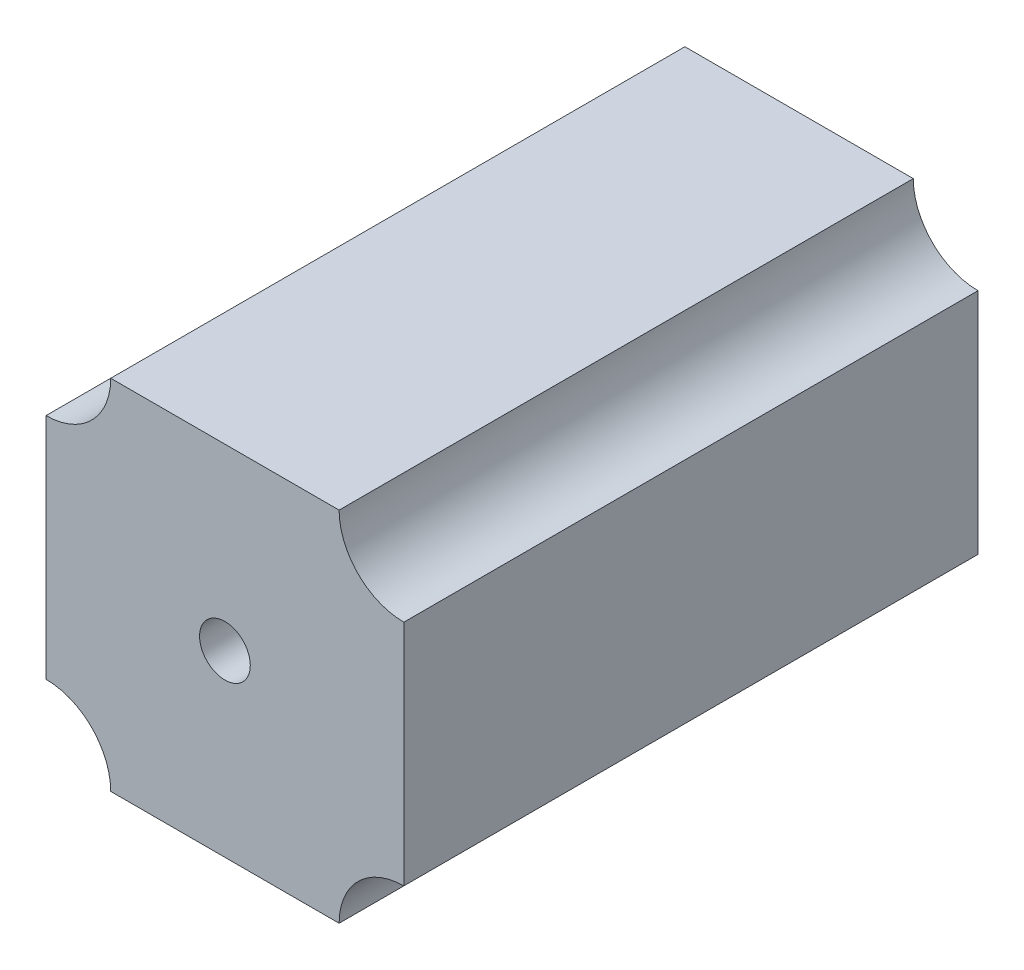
from build123d import *

# Parameters (mm, degrees)
EXTRUDE_1_DEPTH     = 90.5
SKETCH_2_R          = 4
CUT_EXTRUDE_1_DEPTH = 90.5


with BuildPart() as part:
    # Sketch 1 → Extrude 1 (new body)
    with BuildSketch(Plane.XY):
        with BuildLine():
            Line((18, -28.2), (-18, -28.2))
            ThreePointArc((-18, -28.2), (-20.987510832, -20.987510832), (-28.2, -18))
            Line((-28.2, -18), (-28.2, 18))
            ThreePointArc((-28.2, 18), (-20.987510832, 20.987510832), (-18, 28.2))
            Line((-18, 28.2), (18, 28.2))
            ThreePointArc((18, 28.2), (20.987510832, 20.987510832), (28.2, 18))
            Line((28.2, 18), (28.2, -18))
            ThreePointArc((28.2, -18), (20.987510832, -20.987510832), (18, -28.2))
        make_face()
    extrude(amount=EXTRUDE_1_DEPTH)

    # Sketch 2 → Cut-Extrude 1 (cut)
    with BuildSketch(Plane.XY.offset(90.5)):
        Circle(SKETCH_2_R)
    extrude(amount=-CUT_EXTRUDE_1_DEPTH, mode=Mode.SUBTRACT)


solid = part.part
